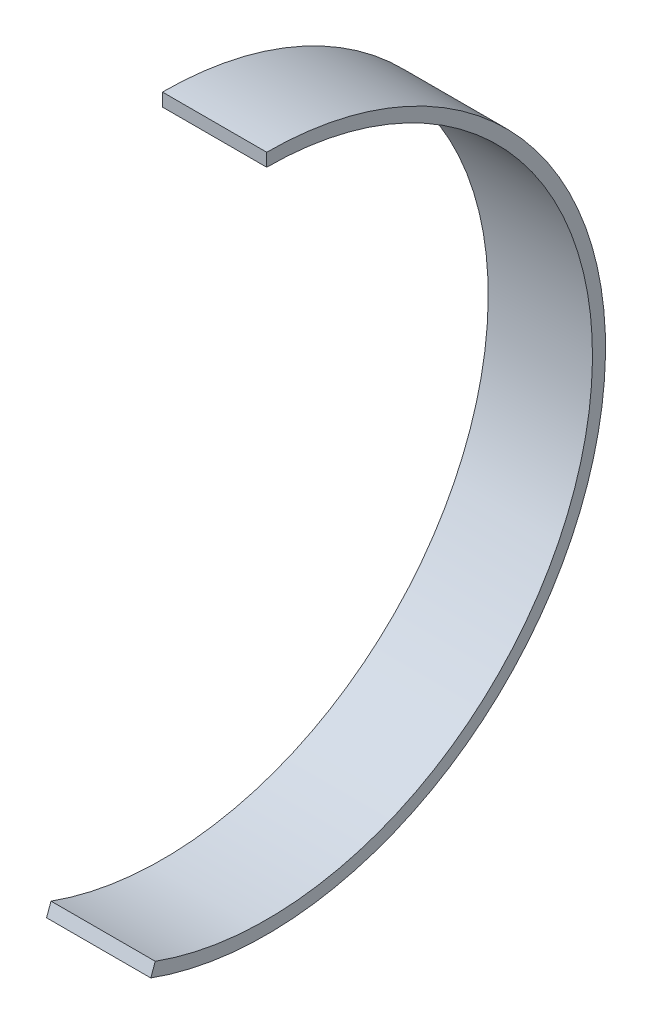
ISO-10303-21;
HEADER;
FILE_DESCRIPTION(('STEP AP214'),'2;1');
FILE_NAME('part.step','',(''),(''),'','','');
FILE_SCHEMA(('AUTOMOTIVE_DESIGN { 1 0 10303 214 1 1 1 1 }'));
ENDSEC;
DATA;
#1=APPLICATION_CONTEXT('core data for automotive mechanical design processes');
#2=APPLICATION_PROTOCOL_DEFINITION('international standard','automotive_design',2000,#1);
#3=PRODUCT_CONTEXT('',#1,'mechanical');
#4=PRODUCT('Part','Part','',(#3));
#5=PRODUCT_RELATED_PRODUCT_CATEGORY('part','',(#4));
#6=PRODUCT_DEFINITION_FORMATION('','',#4);
#7=PRODUCT_DEFINITION_CONTEXT('part definition',#1,'design');
#8=PRODUCT_DEFINITION('design','',#6,#7);
#9=PRODUCT_DEFINITION_SHAPE('','',#8);
#10=(LENGTH_UNIT() NAMED_UNIT(*) SI_UNIT(.MILLI.,.METRE.));
#11=(NAMED_UNIT(*) PLANE_ANGLE_UNIT() SI_UNIT($,.RADIAN.));
#12=(NAMED_UNIT(*) SI_UNIT($,.STERADIAN.) SOLID_ANGLE_UNIT());
#13=UNCERTAINTY_MEASURE_WITH_UNIT(LENGTH_MEASURE(1.E-05),#10,'distance_accuracy_value','');
#14=(GEOMETRIC_REPRESENTATION_CONTEXT(3) GLOBAL_UNCERTAINTY_ASSIGNED_CONTEXT((#13)) GLOBAL_UNIT_ASSIGNED_CONTEXT((#10,
#11,#12)) REPRESENTATION_CONTEXT('',''));
#15=CARTESIAN_POINT('',(0.,0.,0.));
#16=DIRECTION('',(0.,0.,1.));
#17=DIRECTION('',(1.,0.,0.));
#18=AXIS2_PLACEMENT_3D('',#15,#16,#17);
#19=CARTESIAN_POINT('',(-2.,-12.2160040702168,4.44626186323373));
#20=DIRECTION('',(-1.,0.,0.));
#21=DIRECTION('',(0.,0.,1.));
#22=AXIS2_PLACEMENT_3D('',#19,#20,#21);
#23=PLANE('',#22);
#24=CARTESIAN_POINT('',(-2.,0.,0.));
#25=DIRECTION('',(1.,0.,0.));
#26=DIRECTION('',(0.,0.,-1.));
#27=AXIS2_PLACEMENT_3D('',#24,#25,#26);
#28=CIRCLE('',#27,12.5);
#29=CARTESIAN_POINT('',(-2.,-11.7461577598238,4.27525179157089));
#30=VERTEX_POINT('',#29);
#31=CARTESIAN_POINT('',(-2.,12.5,0.));
#32=VERTEX_POINT('',#31);
#33=EDGE_CURVE('E11',#30,#32,#28,.T.);
#34=ORIENTED_EDGE('',*,*,#33,.T.);
#35=DIRECTION('',(0.,-1.,0.));
#36=VECTOR('',#35,1.);
#37=CARTESIAN_POINT('',(-2.,13.,0.));
#38=LINE('',#37,#36);
#39=CARTESIAN_POINT('',(-2.,13.,0.));
#40=VERTEX_POINT('',#39);
#41=EDGE_CURVE('E71',#40,#32,#38,.T.);
#42=ORIENTED_EDGE('',*,*,#41,.F.);
#43=CARTESIAN_POINT('',(-2.,0.,0.));
#44=DIRECTION('',(1.,0.,0.));
#45=DIRECTION('',(0.,0.,-1.));
#46=AXIS2_PLACEMENT_3D('',#43,#44,#45);
#47=CIRCLE('',#46,13.);
#48=CARTESIAN_POINT('',(-2.,-12.2160040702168,4.44626186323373));
#49=VERTEX_POINT('',#48);
#50=EDGE_CURVE('E46',#49,#40,#47,.T.);
#51=ORIENTED_EDGE('',*,*,#50,.F.);
#52=DIRECTION('',(0.,0.939692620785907,-0.342020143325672));
#53=VECTOR('',#52,1.);
#54=CARTESIAN_POINT('',(-2.,-12.2160040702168,4.44626186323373));
#55=LINE('',#54,#53);
#56=EDGE_CURVE('E73',#49,#30,#55,.T.);
#57=ORIENTED_EDGE('',*,*,#56,.T.);
#58=EDGE_LOOP('',(#34,#42,#51,#57));
#59=FACE_BOUND('',#58,.T.);
#60=ADVANCED_FACE('F31',(#59),#23,.T.);
#61=CARTESIAN_POINT('',(0.,0.,0.));
#62=DIRECTION('',(1.,0.,0.));
#63=DIRECTION('',(0.,0.,-1.));
#64=AXIS2_PLACEMENT_3D('',#61,#62,#63);
#65=CYLINDRICAL_SURFACE('',#64,12.5);
#66=CARTESIAN_POINT('',(2.,0.,0.));
#67=DIRECTION('',(1.,0.,0.));
#68=DIRECTION('',(0.,0.,-1.));
#69=AXIS2_PLACEMENT_3D('',#66,#67,#68);
#70=CIRCLE('',#69,12.5);
#71=CARTESIAN_POINT('',(2.,-11.7461577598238,4.27525179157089));
#72=VERTEX_POINT('',#71);
#73=CARTESIAN_POINT('',(2.,12.5,0.));
#74=VERTEX_POINT('',#73);
#75=EDGE_CURVE('E39',#72,#74,#70,.T.);
#76=ORIENTED_EDGE('',*,*,#75,.T.);
#77=DIRECTION('',(1.,0.,0.));
#78=VECTOR('',#77,1.);
#79=CARTESIAN_POINT('',(-2.,12.5,0.));
#80=LINE('',#79,#78);
#81=EDGE_CURVE('E82',#32,#74,#80,.T.);
#82=ORIENTED_EDGE('',*,*,#81,.F.);
#83=ORIENTED_EDGE('',*,*,#33,.F.);
#84=DIRECTION('',(1.,0.,0.));
#85=VECTOR('',#84,1.);
#86=CARTESIAN_POINT('',(-2.,-11.7461577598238,4.27525179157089));
#87=LINE('',#86,#85);
#88=EDGE_CURVE('E92',#30,#72,#87,.T.);
#89=ORIENTED_EDGE('',*,*,#88,.T.);
#90=EDGE_LOOP('',(#76,#82,#83,#89));
#91=FACE_BOUND('',#90,.T.);
#92=ADVANCED_FACE('F33',(#91),#65,.F.);
#93=CARTESIAN_POINT('',(2.,-12.2160040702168,4.44626186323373));
#94=DIRECTION('',(1.,0.,0.));
#95=DIRECTION('',(0.,0.,-1.));
#96=AXIS2_PLACEMENT_3D('',#93,#94,#95);
#97=PLANE('',#96);
#98=CARTESIAN_POINT('',(2.,0.,0.));
#99=DIRECTION('',(1.,0.,0.));
#100=DIRECTION('',(0.,0.,-1.));
#101=AXIS2_PLACEMENT_3D('',#98,#99,#100);
#102=CIRCLE('',#101,13.);
#103=CARTESIAN_POINT('',(2.,-12.2160040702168,4.44626186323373));
#104=VERTEX_POINT('',#103);
#105=CARTESIAN_POINT('',(2.,13.,0.));
#106=VERTEX_POINT('',#105);
#107=EDGE_CURVE('E54',#104,#106,#102,.T.);
#108=ORIENTED_EDGE('',*,*,#107,.T.);
#109=DIRECTION('',(0.,1.,0.));
#110=VECTOR('',#109,1.);
#111=CARTESIAN_POINT('',(2.,13.,0.));
#112=LINE('',#111,#110);
#113=EDGE_CURVE('E86',#74,#106,#112,.T.);
#114=ORIENTED_EDGE('',*,*,#113,.F.);
#115=ORIENTED_EDGE('',*,*,#75,.F.);
#116=DIRECTION('',(0.,-0.939692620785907,0.342020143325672));
#117=VECTOR('',#116,1.);
#118=CARTESIAN_POINT('',(2.,-12.2160040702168,4.44626186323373));
#119=LINE('',#118,#117);
#120=EDGE_CURVE('E94',#72,#104,#119,.T.);
#121=ORIENTED_EDGE('',*,*,#120,.T.);
#122=EDGE_LOOP('',(#108,#114,#115,#121));
#123=FACE_BOUND('',#122,.T.);
#124=ADVANCED_FACE('F100',(#123),#97,.T.);
#125=CARTESIAN_POINT('',(0.,0.,0.));
#126=DIRECTION('',(1.,0.,0.));
#127=DIRECTION('',(0.,0.,-1.));
#128=AXIS2_PLACEMENT_3D('',#125,#126,#127);
#129=CYLINDRICAL_SURFACE('',#128,13.);
#130=DIRECTION('',(-1.,0.,0.));
#131=VECTOR('',#130,1.);
#132=CARTESIAN_POINT('',(-2.,-12.2160040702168,4.44626186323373));
#133=LINE('',#132,#131);
#134=EDGE_CURVE('E96',#104,#49,#133,.T.);
#135=ORIENTED_EDGE('',*,*,#134,.T.);
#136=ORIENTED_EDGE('',*,*,#50,.T.);
#137=DIRECTION('',(-1.,0.,0.));
#138=VECTOR('',#137,1.);
#139=CARTESIAN_POINT('',(-2.,13.,0.));
#140=LINE('',#139,#138);
#141=EDGE_CURVE('E84',#106,#40,#140,.T.);
#142=ORIENTED_EDGE('',*,*,#141,.F.);
#143=ORIENTED_EDGE('',*,*,#107,.F.);
#144=EDGE_LOOP('',(#135,#136,#142,#143));
#145=FACE_BOUND('',#144,.T.);
#146=ADVANCED_FACE('F103',(#145),#129,.T.);
#147=CARTESIAN_POINT('',(-2.,-11.7461577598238,4.27525179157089));
#148=DIRECTION('',(0.,-0.342020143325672,-0.939692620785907));
#149=DIRECTION('',(1.,0.,0.));
#150=AXIS2_PLACEMENT_3D('',#147,#148,#149);
#151=PLANE('',#150);
#152=ORIENTED_EDGE('',*,*,#56,.F.);
#153=ORIENTED_EDGE('',*,*,#134,.F.);
#154=ORIENTED_EDGE('',*,*,#120,.F.);
#155=ORIENTED_EDGE('',*,*,#88,.F.);
#156=EDGE_LOOP('',(#152,#153,#154,#155));
#157=FACE_BOUND('',#156,.T.);
#158=ADVANCED_FACE('F105',(#157),#151,.F.);
#159=CARTESIAN_POINT('',(-2.,12.5,0.));
#160=DIRECTION('',(0.,0.,1.));
#161=DIRECTION('',(1.,0.,0.));
#162=AXIS2_PLACEMENT_3D('',#159,#160,#161);
#163=PLANE('',#162);
#164=ORIENTED_EDGE('',*,*,#41,.T.);
#165=ORIENTED_EDGE('',*,*,#81,.T.);
#166=ORIENTED_EDGE('',*,*,#113,.T.);
#167=ORIENTED_EDGE('',*,*,#141,.T.);
#168=EDGE_LOOP('',(#164,#165,#166,#167));
#169=FACE_BOUND('',#168,.T.);
#170=ADVANCED_FACE('F80',(#169),#163,.T.);
#171=CLOSED_SHELL('',(#60,#92,#124,#146,#158,#170));
#172=MANIFOLD_SOLID_BREP('B2',#171);
#173=ADVANCED_BREP_SHAPE_REPRESENTATION('',(#18,#172),#14);
#174=SHAPE_DEFINITION_REPRESENTATION(#9,#173);
ENDSEC;
END-ISO-10303-21;
